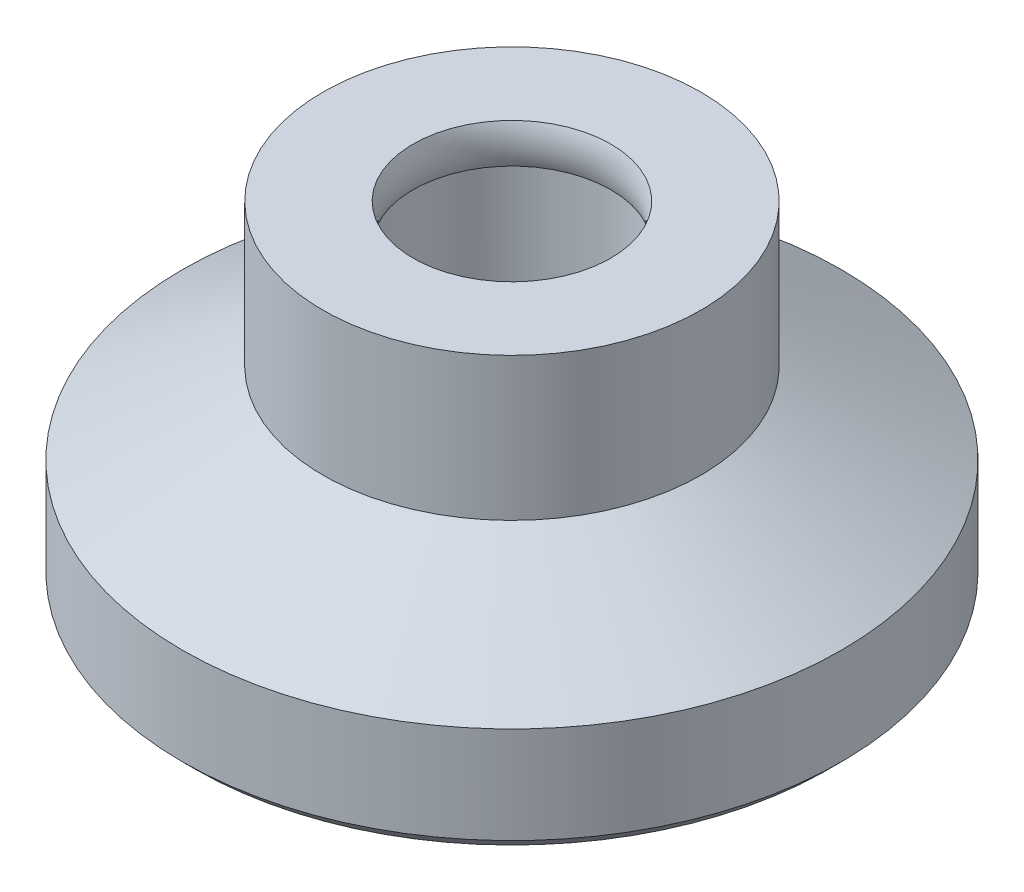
from build123d import *

# Parameters (mm, degrees)
SKETCH1_R      = 4.3
EXTRUDE1_DEPTH = 3.8
SKETCH3_R      = 7.5
EXTRUDE2_DEPTH = 2.5
CHAMFER1_SIZE  = 0.3


with BuildPart() as part:
    # Sketch1 → Extrude1 (new, symmetric)
    with BuildSketch(Plane(origin=(0, 0, 0), x_dir=(1, 0, 0), z_dir=(0, 1, 0))):
        with Locations(Location((0, 0, 0), (0, 0, 90))):
            Circle(SKETCH1_R)
    extrude(amount=EXTRUDE1_DEPTH, both=True)

    # Sketch3 → Extrude2 (add)
    with BuildSketch(Plane.XZ.offset(3.8)):
        with Locations(Location((0, 0, 0), (0, 0, 270))):
            Circle(SKETCH3_R)
    extrude(amount=-EXTRUDE2_DEPTH)

    # Sketch4 → Revolve1 (revolve)
    with BuildSketch(Plane.XY, mode=Mode.PRIVATE) as revolve1_sk:
        Polygon((-7.5, -1.3), (-4.3, 0.547520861), (-4.3, -1.3), align=None)
    revolve(revolve1_sk.sketch.rotate(Axis((0, 3.8, 0), (0, -1, 0)), 90), axis=Axis((0, 3.8, 0), (0, -1, 0)))

    # Chamfer1
    chamfer1_edges = [part.edges().sort_by_distance(p)[0] for p in [
        (0, -3.8, 7.5),
    ]]
    chamfer(chamfer1_edges, length=CHAMFER1_SIZE)

    # Sketch5 → Cut-Revolve1 (revolve, cut)
    with BuildSketch(Plane.XY, mode=Mode.PRIVATE) as cut_revolve1_sk:
        with BuildLine():
            Line((0, 3.8), (2.25, 3.8))
            ThreePointArc((2.25, 3.8), (2.16, 3.35), (2.25, 2.9))
            Line((2.25, 2.9), (2.25, -0.000961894))
            Line((2.25, -0.000961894), (0, -1.3))
            Line((0, -1.3), (0, 3.8))
        make_face()
    revolve(cut_revolve1_sk.sketch.rotate(Axis((0, 0, 0), (0, 1, 0)), 270), axis=Axis((0, 0, 0), (0, 1, 0)), mode=Mode.SUBTRACT)


solid = part.part
